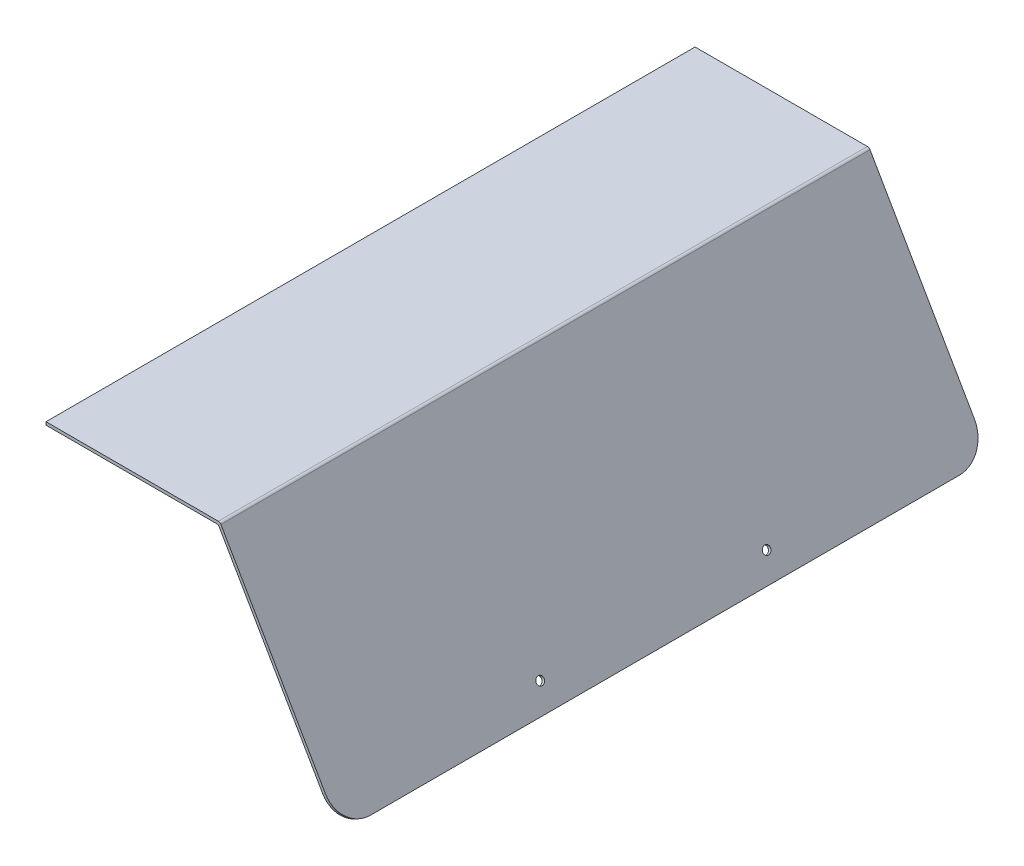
from build123d import *

# Parameters (mm, degrees)
BOSS_EXTRU_1_DEPTH      = 430
CONG_1_R                = 20
ESQUISSE3_R             = 2.5875
ENL_V_MAT_EXTRU_2_DEPTH = 2


with BuildPart() as part:
    # Esquisse1 → Boss.-Extru.1 (new body)
    with BuildSketch(Plane.XY):
        with BuildLine():
            Line((39, 135.000000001), (152, 135.000000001))
            ThreePointArc((152, 135.000000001), (153, 134.732050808), (153.732050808, 134.000000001))
            Line((153.732050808, 134.000000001), (232.354361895, -2.177837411))
            Line((232.354361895, -2.177837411), (234.086412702, -1.177837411))
            Line((234.086412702, -1.177837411), (154.886751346, 136.000000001))
            ThreePointArc((154.886751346, 136.000000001), (154.154700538, 136.732050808), (153.154700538, 137.000000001))
            Line((153.154700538, 137.000000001), (39, 137.000000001))
            Line((39, 137.000000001), (39, 135.000000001))
        make_face()
    extrude(amount=-BOSS_EXTRU_1_DEPTH)

    # Cong_1
    cong_1_edges = [part.edges().sort_by_distance(p)[0] for p in [
        (233.220387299, -1.677837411, -430),
        (233.220387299, -1.677837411, 0),
    ]]
    fillet(cong_1_edges, radius=CONG_1_R)

    # Esquisse3 → Enl_v. mat.-Extru.2 (cut)
    with BuildSketch(Plane(origin=(175.054790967, 101.067930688, 0), x_dir=(0, 0, -1), z_dir=(0.8660254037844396, 0.49999999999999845, 0))):
        with Locations(Location((139.999999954, -102.7132433, 0), (0, 0, 90))):
            Circle(ESQUISSE3_R)
        with Locations(Location((290.000000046, -102.7132433, 0), (0, 0, 90))):
            Circle(ESQUISSE3_R)
    extrude(amount=-ENL_V_MAT_EXTRU_2_DEPTH, mode=Mode.SUBTRACT)


solid = part.part
